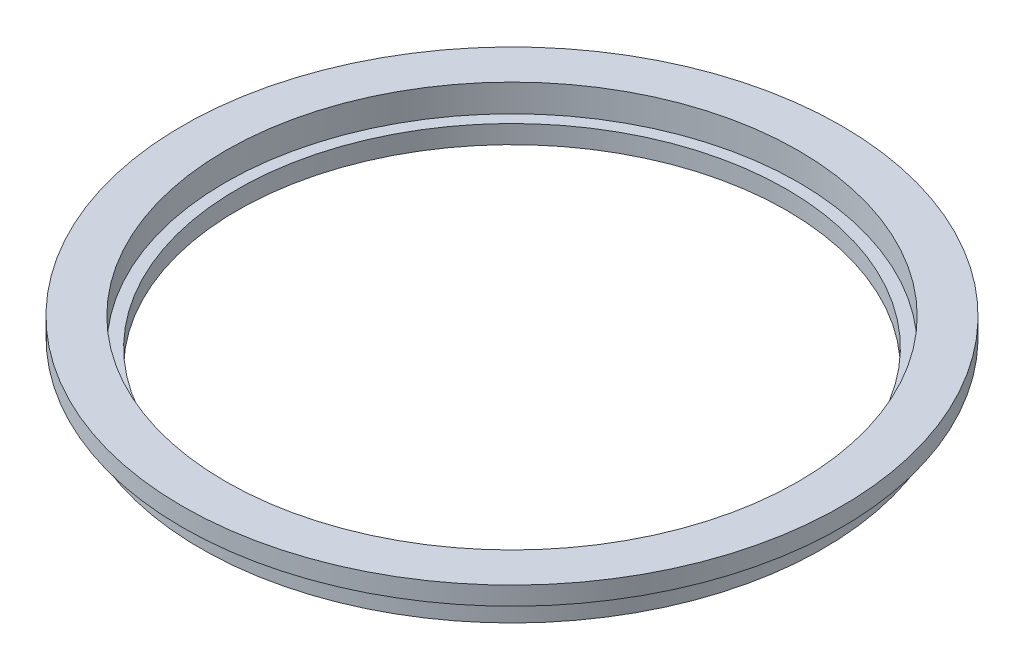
ISO-10303-21;
HEADER;
FILE_DESCRIPTION(('STEP AP214'),'2;1');
FILE_NAME('part.step','',(''),(''),'','','');
FILE_SCHEMA(('AUTOMOTIVE_DESIGN { 1 0 10303 214 1 1 1 1 }'));
ENDSEC;
DATA;
#1=APPLICATION_CONTEXT('core data for automotive mechanical design processes');
#2=APPLICATION_PROTOCOL_DEFINITION('international standard','automotive_design',2000,#1);
#3=PRODUCT_CONTEXT('',#1,'mechanical');
#4=PRODUCT('Part','Part','',(#3));
#5=PRODUCT_RELATED_PRODUCT_CATEGORY('part','',(#4));
#6=PRODUCT_DEFINITION_FORMATION('','',#4);
#7=PRODUCT_DEFINITION_CONTEXT('part definition',#1,'design');
#8=PRODUCT_DEFINITION('design','',#6,#7);
#9=PRODUCT_DEFINITION_SHAPE('','',#8);
#10=(LENGTH_UNIT() NAMED_UNIT(*) SI_UNIT(.MILLI.,.METRE.));
#11=(NAMED_UNIT(*) PLANE_ANGLE_UNIT() SI_UNIT($,.RADIAN.));
#12=(NAMED_UNIT(*) SI_UNIT($,.STERADIAN.) SOLID_ANGLE_UNIT());
#13=UNCERTAINTY_MEASURE_WITH_UNIT(LENGTH_MEASURE(1.E-05),#10,'distance_accuracy_value','');
#14=(GEOMETRIC_REPRESENTATION_CONTEXT(3) GLOBAL_UNCERTAINTY_ASSIGNED_CONTEXT((#13)) GLOBAL_UNIT_ASSIGNED_CONTEXT((#10,
#11,#12)) REPRESENTATION_CONTEXT('',''));
#15=CARTESIAN_POINT('',(0.,0.,0.));
#16=DIRECTION('',(0.,0.,1.));
#17=DIRECTION('',(1.,0.,0.));
#18=AXIS2_PLACEMENT_3D('',#15,#16,#17);
#19=CARTESIAN_POINT('',(0.,1.25,0.));
#20=DIRECTION('',(0.,-1.,0.));
#21=DIRECTION('',(0.,0.,-1.));
#22=AXIS2_PLACEMENT_3D('',#19,#20,#21);
#23=CYLINDRICAL_SURFACE('',#22,18.);
#24=CARTESIAN_POINT('',(0.,1.25,0.));
#25=DIRECTION('',(0.,1.,0.));
#26=DIRECTION('',(0.,0.,1.));
#27=AXIS2_PLACEMENT_3D('',#24,#25,#26);
#28=CIRCLE('',#27,18.);
#29=CARTESIAN_POINT('',(0.,1.25,18.));
#30=VERTEX_POINT('',#29);
#31=EDGE_CURVE('E11',#30,#30,#28,.T.);
#32=ORIENTED_EDGE('',*,*,#31,.F.);
#33=EDGE_LOOP('',(#32));
#34=FACE_BOUND('',#33,.T.);
#35=CARTESIAN_POINT('',(0.,0.25,0.));
#36=DIRECTION('',(0.,-1.,0.));
#37=DIRECTION('',(0.,0.,-1.));
#38=AXIS2_PLACEMENT_3D('',#35,#36,#37);
#39=CIRCLE('',#38,18.);
#40=CARTESIAN_POINT('',(0.,0.25,-18.));
#41=VERTEX_POINT('',#40);
#42=EDGE_CURVE('E70',#41,#41,#39,.T.);
#43=ORIENTED_EDGE('',*,*,#42,.F.);
#44=EDGE_LOOP('',(#43));
#45=FACE_BOUND('',#44,.T.);
#46=ADVANCED_FACE('F43',(#34,#45),#23,.T.);
#47=CARTESIAN_POINT('',(0.,-1.25,0.));
#48=DIRECTION('',(0.,1.,0.));
#49=DIRECTION('',(0.,0.,1.));
#50=AXIS2_PLACEMENT_3D('',#47,#48,#49);
#51=PLANE('',#50);
#52=CARTESIAN_POINT('',(0.,-1.25,0.));
#53=DIRECTION('',(0.,1.,0.));
#54=DIRECTION('',(0.,0.,1.));
#55=AXIS2_PLACEMENT_3D('',#52,#53,#54);
#56=CIRCLE('',#55,15.);
#57=CARTESIAN_POINT('',(0.,-1.25,15.));
#58=VERTEX_POINT('',#57);
#59=EDGE_CURVE('E61',#58,#58,#56,.F.);
#60=ORIENTED_EDGE('',*,*,#59,.F.);
#61=EDGE_LOOP('',(#60));
#62=FACE_BOUND('',#61,.T.);
#63=CARTESIAN_POINT('',(0.,-1.25,0.));
#64=DIRECTION('',(0.,-1.,0.));
#65=DIRECTION('',(0.,0.,-1.));
#66=AXIS2_PLACEMENT_3D('',#63,#64,#65);
#67=CIRCLE('',#66,17.);
#68=CARTESIAN_POINT('',(0.,-1.25,-17.));
#69=VERTEX_POINT('',#68);
#70=EDGE_CURVE('E75',#69,#69,#67,.T.);
#71=ORIENTED_EDGE('',*,*,#70,.T.);
#72=EDGE_LOOP('',(#71));
#73=FACE_BOUND('',#72,.T.);
#74=ADVANCED_FACE('F94',(#62,#73),#51,.F.);
#75=CARTESIAN_POINT('',(0.,1.25,0.));
#76=DIRECTION('',(0.,1.,0.));
#77=DIRECTION('',(0.,0.,1.));
#78=AXIS2_PLACEMENT_3D('',#75,#76,#77);
#79=PLANE('',#78);
#80=CARTESIAN_POINT('',(0.,1.25,0.));
#81=DIRECTION('',(0.,1.,0.));
#82=DIRECTION('',(0.,0.,1.));
#83=AXIS2_PLACEMENT_3D('',#80,#81,#82);
#84=CIRCLE('',#83,15.65);
#85=CARTESIAN_POINT('',(0.,1.25,15.65));
#86=VERTEX_POINT('',#85);
#87=EDGE_CURVE('E55',#86,#86,#84,.T.);
#88=ORIENTED_EDGE('',*,*,#87,.F.);
#89=EDGE_LOOP('',(#88));
#90=FACE_BOUND('',#89,.T.);
#91=ORIENTED_EDGE('',*,*,#31,.T.);
#92=EDGE_LOOP('',(#91));
#93=FACE_BOUND('',#92,.T.);
#94=ADVANCED_FACE('F99',(#90,#93),#79,.T.);
#95=CARTESIAN_POINT('',(0.,-0.25,0.));
#96=DIRECTION('',(0.,1.,0.));
#97=DIRECTION('',(0.,0.,1.));
#98=AXIS2_PLACEMENT_3D('',#95,#96,#97);
#99=CYLINDRICAL_SURFACE('',#98,15.65);
#100=CARTESIAN_POINT('',(0.,-0.25,0.));
#101=DIRECTION('',(0.,1.,0.));
#102=DIRECTION('',(0.,0.,1.));
#103=AXIS2_PLACEMENT_3D('',#100,#101,#102);
#104=CIRCLE('',#103,15.65);
#105=CARTESIAN_POINT('',(0.,-0.25,15.65));
#106=VERTEX_POINT('',#105);
#107=EDGE_CURVE('E50',#106,#106,#104,.T.);
#108=ORIENTED_EDGE('',*,*,#107,.F.);
#109=EDGE_LOOP('',(#108));
#110=FACE_BOUND('',#109,.T.);
#111=ORIENTED_EDGE('',*,*,#87,.T.);
#112=EDGE_LOOP('',(#111));
#113=FACE_BOUND('',#112,.T.);
#114=ADVANCED_FACE('F104',(#110,#113),#99,.F.);
#115=CARTESIAN_POINT('',(0.,-0.25,0.));
#116=DIRECTION('',(0.,1.,0.));
#117=DIRECTION('',(0.,0.,1.));
#118=AXIS2_PLACEMENT_3D('',#115,#116,#117);
#119=PLANE('',#118);
#120=CARTESIAN_POINT('',(0.,-0.25,0.));
#121=DIRECTION('',(0.,1.,0.));
#122=DIRECTION('',(0.,0.,1.));
#123=AXIS2_PLACEMENT_3D('',#120,#121,#122);
#124=CIRCLE('',#123,15.);
#125=CARTESIAN_POINT('',(0.,-0.25,15.));
#126=VERTEX_POINT('',#125);
#127=EDGE_CURVE('E66',#126,#126,#124,.T.);
#128=ORIENTED_EDGE('',*,*,#127,.F.);
#129=EDGE_LOOP('',(#128));
#130=FACE_BOUND('',#129,.T.);
#131=ORIENTED_EDGE('',*,*,#107,.T.);
#132=EDGE_LOOP('',(#131));
#133=FACE_BOUND('',#132,.T.);
#134=ADVANCED_FACE('F112',(#130,#133),#119,.T.);
#135=CARTESIAN_POINT('',(0.,-1.251,0.));
#136=DIRECTION('',(0.,1.,0.));
#137=DIRECTION('',(0.,0.,1.));
#138=AXIS2_PLACEMENT_3D('',#135,#136,#137);
#139=CYLINDRICAL_SURFACE('',#138,15.);
#140=ORIENTED_EDGE('',*,*,#127,.T.);
#141=EDGE_LOOP('',(#140));
#142=FACE_BOUND('',#141,.T.);
#143=ORIENTED_EDGE('',*,*,#59,.T.);
#144=EDGE_LOOP('',(#143));
#145=FACE_BOUND('',#144,.T.);
#146=ADVANCED_FACE('F89',(#142,#145),#139,.F.);
#147=CARTESIAN_POINT('',(0.,0.25,0.));
#148=DIRECTION('',(0.,-1.,0.));
#149=DIRECTION('',(0.,0.,-1.));
#150=AXIS2_PLACEMENT_3D('',#147,#148,#149);
#151=PLANE('',#150);
#152=CARTESIAN_POINT('',(0.,0.25,0.));
#153=DIRECTION('',(0.,-1.,0.));
#154=DIRECTION('',(0.,0.,-1.));
#155=AXIS2_PLACEMENT_3D('',#152,#153,#154);
#156=CIRCLE('',#155,17.);
#157=CARTESIAN_POINT('',(0.,0.25,-17.));
#158=VERTEX_POINT('',#157);
#159=EDGE_CURVE('E74',#158,#158,#156,.T.);
#160=ORIENTED_EDGE('',*,*,#159,.F.);
#161=EDGE_LOOP('',(#160));
#162=FACE_BOUND('',#161,.T.);
#163=ORIENTED_EDGE('',*,*,#42,.T.);
#164=EDGE_LOOP('',(#163));
#165=FACE_BOUND('',#164,.T.);
#166=ADVANCED_FACE('F86',(#162,#165),#151,.T.);
#167=CARTESIAN_POINT('',(0.,0.25,0.));
#168=DIRECTION('',(0.,-1.,0.));
#169=DIRECTION('',(0.,0.,-1.));
#170=AXIS2_PLACEMENT_3D('',#167,#168,#169);
#171=CYLINDRICAL_SURFACE('',#170,17.);
#172=ORIENTED_EDGE('',*,*,#159,.T.);
#173=EDGE_LOOP('',(#172));
#174=FACE_BOUND('',#173,.T.);
#175=ORIENTED_EDGE('',*,*,#70,.F.);
#176=EDGE_LOOP('',(#175));
#177=FACE_BOUND('',#176,.T.);
#178=ADVANCED_FACE('F83',(#174,#177),#171,.T.);
#179=CLOSED_SHELL('',(#46,#74,#94,#114,#134,#146,#166,#178));
#180=MANIFOLD_SOLID_BREP('B2',#179);
#181=ADVANCED_BREP_SHAPE_REPRESENTATION('',(#18,#180),#14);
#182=SHAPE_DEFINITION_REPRESENTATION(#9,#181);
ENDSEC;
END-ISO-10303-21;
